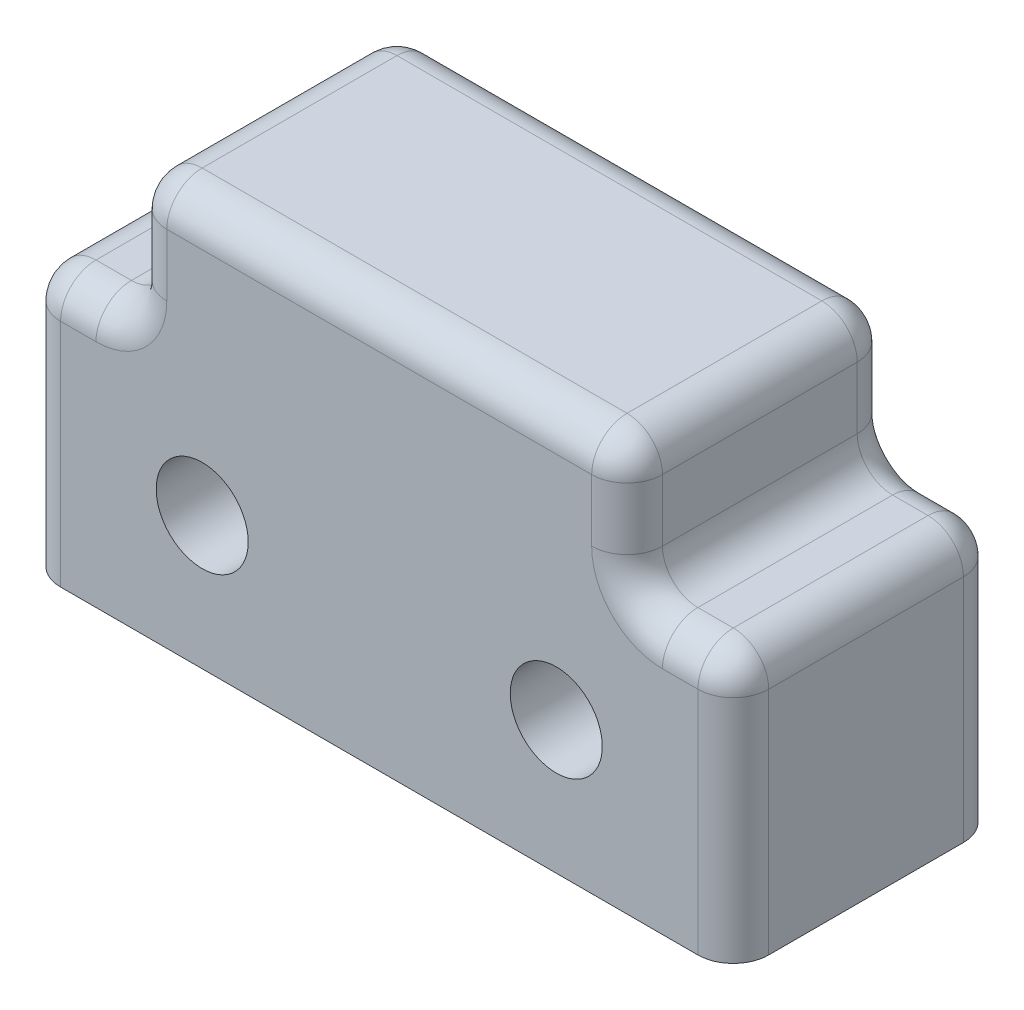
from build123d import *

# Parameters (mm, degrees)
SKETCH1_W           = 50.8
SKETCH1_H           = 19.05
BOSS_EXTRUDE1_DEPTH = 19.05
SKETCH3_R           = 3.175
CUT_EXTRUDE1_DEPTH  = 58.501695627
SKETCH4_R           = 3.130247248
CUT_EXTRUDE3_DEPTH  = 58.501695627
SKETCH6_W           = 35.56
SKETCH6_H           = 19.05
BOSS_EXTRUDE2_DEPTH = 9.525
SKETCH7_R           = 3.480096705
SKETCH7_R_2         = 3.446660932
CUT_EXTRUDE4_DEPTH  = 62.319435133
FILLET1_R           = 2.54
FILLET2_R           = 2.54
FILLET3_R           = 2.54
BOSS_EXTRUDE3_START = -19.05
SKETCH8_R           = 3.446660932
SKETCH8_R_2         = 3.302
BOSS_EXTRUDE3_DEPTH = 19.05
SKETCH9_R           = 3.480096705
SKETCH9_R_2         = 3.302
BOSS_EXTRUDE4_DEPTH = 19.05


with BuildPart() as part:
    # Sketch1 → Boss-Extrude1 (new body)
    with BuildSketch(Plane.XY):
        with Locations((25.4, 9.525)):
            Rectangle(SKETCH1_W, SKETCH1_H)
    extrude(amount=BOSS_EXTRUDE1_DEPTH)

    # Sketch3 → Cut-Extrude1 (cut, through all)
    with BuildSketch(Plane.XY.offset(19.05)):
        with Locations((12.7, 9.525)):
            Circle(SKETCH3_R)
    extrude(amount=-CUT_EXTRUDE1_DEPTH, mode=Mode.SUBTRACT)

    # Sketch4 → Cut-Extrude3 (cut, through all)
    with BuildSketch(Plane.XY.offset(19.05)):
        with Locations((38.1, 9.525)):
            Circle(SKETCH4_R)
    extrude(amount=-CUT_EXTRUDE3_DEPTH, mode=Mode.SUBTRACT)

    # Sketch6 → Boss-Extrude2 (add)
    with BuildSketch(Plane(origin=(0, 19.05, 0), x_dir=(1, 0, 0), z_dir=(0, 1, 0))):
        with Locations((25.4, -9.525)):
            Rectangle(SKETCH6_W, SKETCH6_H)
    extrude(amount=BOSS_EXTRUDE2_DEPTH)

    # Sketch7 → Cut-Extrude4 (cut, through all)
    with BuildSketch(Plane(origin=(0, 0, 0), x_dir=(-1, 0, 0), z_dir=(0, 0, -1))):
        with Locations((-38.1, 9.525)):
            Circle(SKETCH7_R)
        with Locations((-12.7, 9.525)):
            Circle(SKETCH7_R_2)
    extrude(amount=-CUT_EXTRUDE4_DEPTH, mode=Mode.SUBTRACT)

    # Fillet1
    fillet1_edges = [part.edges().sort_by_distance(p)[0] for p in [
        (7.62, 19.05, 9.525),
        (43.18, 19.05, 9.525),
        (7.62, 28.575, 9.525),
        (43.18, 28.575, 9.525),
        (0, 19.05, 9.525),
        (50.8, 19.05, 9.525),
    ]]
    fillet(fillet1_edges, radius=FILLET1_R)

    # Fillet2
    fillet2_edges = [part.edges().sort_by_distance(p)[0] for p in [
        (50.8, 8.255, 0),
        (0, 8.255, 0),
        (3.81, 19.05, 0),
        (7.62, 23.8125, 0),
        (25.4, 28.575, 0),
        (43.18, 23.8125, 0),
        (46.99, 19.05, 0),
        (50.056051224, 18.306051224, 0),
        (42.436051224, 27.831051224, 0),
        (8.363948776, 27.831051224, 0),
        (0.743948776, 18.306051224, 0),
        (6.876051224, 19.793948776, 0),
        (43.923948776, 19.793948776, 0),
    ]]
    fillet(fillet2_edges, radius=FILLET2_R)

    # Fillet3
    fillet3_edges = [part.edges().sort_by_distance(p)[0] for p in [
        (50.8, 8.255, 19.05),
        (0, 8.255, 19.05),
        (3.81, 19.05, 19.05),
        (46.99, 19.05, 19.05),
        (43.18, 23.8125, 19.05),
        (25.4, 28.575, 19.05),
        (7.62, 23.8125, 19.05),
        (50.056051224, 18.306051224, 19.05),
        (42.436051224, 27.831051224, 19.05),
        (8.363948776, 27.831051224, 19.05),
        (0.743948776, 18.306051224, 19.05),
        (6.876051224, 19.793948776, 19.05),
        (43.923948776, 19.793948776, 19.05),
    ]]
    fillet(fillet3_edges, radius=FILLET3_R)

    # Sketch8 → Boss-Extrude3 (add)
    with BuildSketch(Plane.XY.offset(19.05).offset(BOSS_EXTRUDE3_START)):
        with Locations((12.7, 9.525)):
            Circle(SKETCH8_R)
        with Locations((12.7, 9.525)):
            Circle(SKETCH8_R_2, mode=Mode.SUBTRACT)
    extrude(amount=BOSS_EXTRUDE3_DEPTH)

    # Sketch9 → Boss-Extrude4 (add)
    with BuildSketch(Plane(origin=(0, 0, 0), x_dir=(-1, 0, 0), z_dir=(0, 0, -1))):
        with Locations((-38.1, 9.525)):
            Circle(SKETCH9_R)
        with Locations((-38.1, 9.525)):
            Circle(SKETCH9_R_2, mode=Mode.SUBTRACT)
    extrude(amount=-BOSS_EXTRUDE4_DEPTH)


solid = part.part
